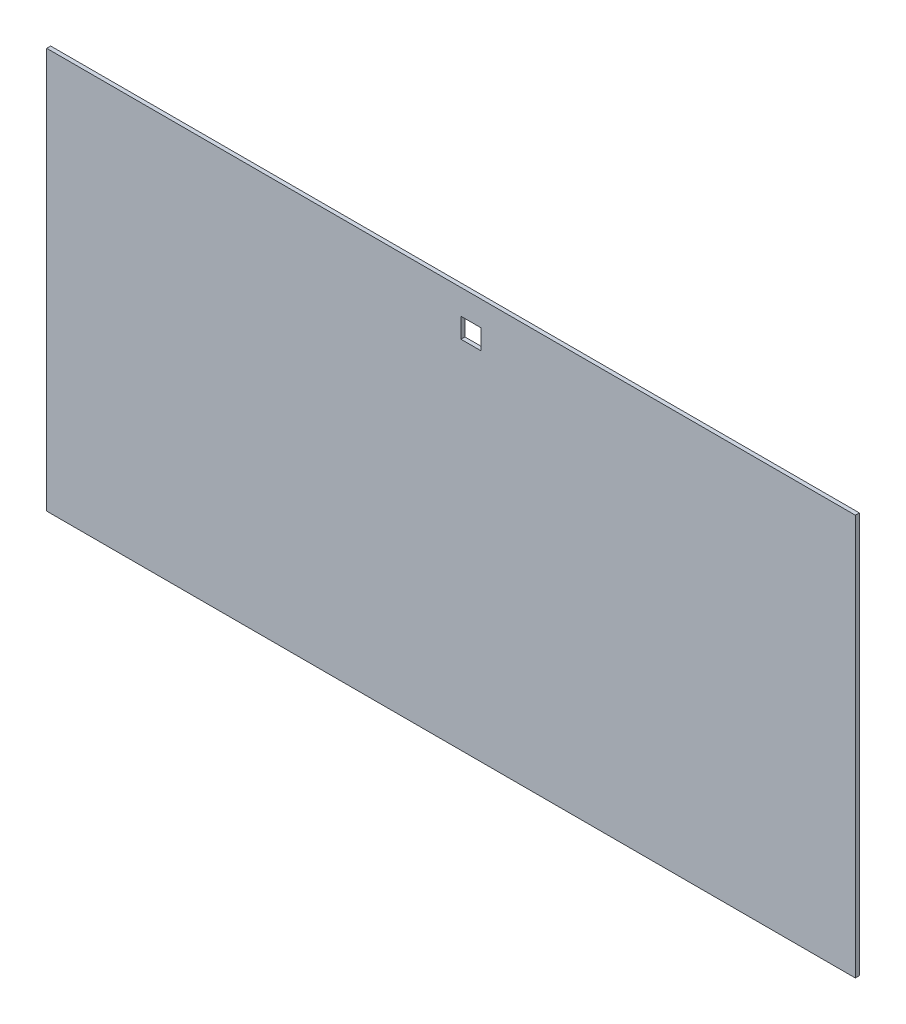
from build123d import *

# Parameters (mm, degrees)
SKIZZE1_W                       = 812
SKIZZE1_H                       = 402.5
AUFSATZ_LINEAR_AUSTRAGEN1_DEPTH = 4
SKIZZE2_W                       = 20
SKIZZE2_H                       = 20
SCHNITT_LINEAR_AUSTRAGEN1_DEPTH = 454.159533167


with BuildPart() as part:
    # Skizze1 → Aufsatz-Linear austragen1 (new body)
    with BuildSketch(Plane.XY):
        Rectangle(SKIZZE1_W, SKIZZE1_H)
    extrude(amount=AUFSATZ_LINEAR_AUSTRAGEN1_DEPTH)

    # Skizze2 → Schnitt-Linear austragen1 (cut, through all)
    with BuildSketch(Plane.XY.offset(4)):
        with Locations((20, 166.25)):
            Rectangle(SKIZZE2_W, SKIZZE2_H)
    extrude(amount=-SCHNITT_LINEAR_AUSTRAGEN1_DEPTH, mode=Mode.SUBTRACT)


solid = part.part
